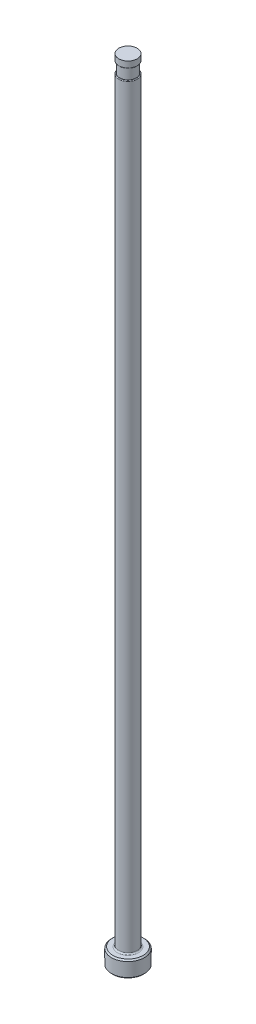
ISO-10303-21;
HEADER;
FILE_DESCRIPTION(('STEP AP214'),'2;1');
FILE_NAME('part.step','',(''),(''),'','','');
FILE_SCHEMA(('AUTOMOTIVE_DESIGN { 1 0 10303 214 1 1 1 1 }'));
ENDSEC;
DATA;
#1=APPLICATION_CONTEXT('core data for automotive mechanical design processes');
#2=APPLICATION_PROTOCOL_DEFINITION('international standard','automotive_design',2000,#1);
#3=PRODUCT_CONTEXT('',#1,'mechanical');
#4=PRODUCT('Part','Part','',(#3));
#5=PRODUCT_RELATED_PRODUCT_CATEGORY('part','',(#4));
#6=PRODUCT_DEFINITION_FORMATION('','',#4);
#7=PRODUCT_DEFINITION_CONTEXT('part definition',#1,'design');
#8=PRODUCT_DEFINITION('design','',#6,#7);
#9=PRODUCT_DEFINITION_SHAPE('','',#8);
#10=(LENGTH_UNIT() NAMED_UNIT(*) SI_UNIT(.MILLI.,.METRE.));
#11=(NAMED_UNIT(*) PLANE_ANGLE_UNIT() SI_UNIT($,.RADIAN.));
#12=(NAMED_UNIT(*) SI_UNIT($,.STERADIAN.) SOLID_ANGLE_UNIT());
#13=UNCERTAINTY_MEASURE_WITH_UNIT(LENGTH_MEASURE(1.E-05),#10,'distance_accuracy_value','');
#14=(GEOMETRIC_REPRESENTATION_CONTEXT(3) GLOBAL_UNCERTAINTY_ASSIGNED_CONTEXT((#13)) GLOBAL_UNIT_ASSIGNED_CONTEXT((#10,
#11,#12)) REPRESENTATION_CONTEXT('',''));
#15=CARTESIAN_POINT('',(0.,0.,0.));
#16=DIRECTION('',(0.,0.,1.));
#17=DIRECTION('',(1.,0.,0.));
#18=AXIS2_PLACEMENT_3D('',#15,#16,#17);
#19=CARTESIAN_POINT('',(-1.78561999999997,151.13,0.));
#20=DIRECTION('',(0.,1.,0.));
#21=DIRECTION('',(0.,0.,1.));
#22=AXIS2_PLACEMENT_3D('',#19,#20,#21);
#23=PLANE('',#22);
#24=CARTESIAN_POINT('',(0.,151.13,0.));
#25=DIRECTION('',(0.,1.,0.));
#26=DIRECTION('',(0.,0.,1.));
#27=AXIS2_PLACEMENT_3D('',#24,#25,#26);
#28=CIRCLE('',#27,1.64591999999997);
#29=CARTESIAN_POINT('',(0.,151.13,1.64591999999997));
#30=VERTEX_POINT('',#29);
#31=EDGE_CURVE('E11',#30,#30,#28,.F.);
#32=ORIENTED_EDGE('',*,*,#31,.T.);
#33=EDGE_LOOP('',(#32));
#34=FACE_BOUND('',#33,.T.);
#35=CARTESIAN_POINT('',(0.,151.13,0.));
#36=DIRECTION('',(0.,1.,0.));
#37=DIRECTION('',(0.,0.,1.));
#38=AXIS2_PLACEMENT_3D('',#35,#36,#37);
#39=CIRCLE('',#38,1.58241999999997);
#40=CARTESIAN_POINT('',(0.,151.13,1.58241999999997));
#41=VERTEX_POINT('',#40);
#42=EDGE_CURVE('E78',#41,#41,#39,.T.);
#43=ORIENTED_EDGE('',*,*,#42,.T.);
#44=EDGE_LOOP('',(#43));
#45=FACE_BOUND('',#44,.T.);
#46=ADVANCED_FACE('F36',(#34,#45),#23,.F.);
#47=CARTESIAN_POINT('',(0.,259.958771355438,0.));
#48=DIRECTION('',(0.,1.,0.));
#49=DIRECTION('',(0.,0.,1.));
#50=AXIS2_PLACEMENT_3D('',#47,#48,#49);
#51=CYLINDRICAL_SURFACE('',#50,1.78561999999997);
#52=DIRECTION('',(0.,1.,0.));
#53=VECTOR('',#52,1.);
#54=CARTESIAN_POINT('',(-1.58241999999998,259.958771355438,-0.827276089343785));
#55=LINE('',#54,#53);
#56=CARTESIAN_POINT('',(-1.58241999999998,148.971,-0.827276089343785));
#57=VERTEX_POINT('',#56);
#58=CARTESIAN_POINT('',(-1.58241999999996,86.614,-0.827276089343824));
#59=VERTEX_POINT('',#58);
#60=EDGE_CURVE('E73',#57,#59,#55,.F.);
#61=ORIENTED_EDGE('',*,*,#60,.F.);
#62=CARTESIAN_POINT('',(0.,148.971,0.));
#63=DIRECTION('',(0.,-1.,0.));
#64=DIRECTION('',(0.,0.,-1.));
#65=AXIS2_PLACEMENT_3D('',#62,#63,#64);
#66=CIRCLE('',#65,1.78561999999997);
#67=CARTESIAN_POINT('',(-1.58241999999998,148.971,0.827276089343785));
#68=VERTEX_POINT('',#67);
#69=EDGE_CURVE('E51',#57,#68,#66,.T.);
#70=ORIENTED_EDGE('',*,*,#69,.T.);
#71=DIRECTION('',(0.,1.,0.));
#72=VECTOR('',#71,1.);
#73=CARTESIAN_POINT('',(-1.58241999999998,259.958771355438,0.827276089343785));
#74=LINE('',#73,#72);
#75=CARTESIAN_POINT('',(-1.58241999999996,86.614,0.827276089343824));
#76=VERTEX_POINT('',#75);
#77=EDGE_CURVE('E84',#76,#68,#74,.T.);
#78=ORIENTED_EDGE('',*,*,#77,.F.);
#79=CARTESIAN_POINT('',(-1.58241999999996,86.614,-0.827276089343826));
#80=CARTESIAN_POINT('',(-1.58241859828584,86.57930589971,-0.827270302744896));
#81=CARTESIAN_POINT('',(-1.58298930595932,86.5446242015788,-0.826188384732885));
#82=CARTESIAN_POINT('',(-1.58525672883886,86.4754213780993,-0.821832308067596));
#83=CARTESIAN_POINT('',(-1.58695392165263,86.4409003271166,-0.81855721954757));
#84=CARTESIAN_POINT('',(-1.59374670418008,86.3372224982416,-0.805306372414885));
#85=CARTESIAN_POINT('',(-1.60054304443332,86.2685662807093,-0.791903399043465));
#86=CARTESIAN_POINT('',(-1.6181445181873,86.1342279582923,-0.755289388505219));
#87=CARTESIAN_POINT('',(-1.62896089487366,86.0685547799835,-0.732050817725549));
#88=CARTESIAN_POINT('',(-1.65351348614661,85.9428437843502,-0.674760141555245));
#89=CARTESIAN_POINT('',(-1.66723753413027,85.8827839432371,-0.640752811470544));
#90=CARTESIAN_POINT('',(-1.69108481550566,85.7895410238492,-0.574000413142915));
#91=CARTESIAN_POINT('',(-1.70092185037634,85.7539825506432,-0.544463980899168));
#92=CARTESIAN_POINT('',(-1.72024188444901,85.6880696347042,-0.479935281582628));
#93=CARTESIAN_POINT('',(-1.72972525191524,85.6577096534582,-0.444948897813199));
#94=CARTESIAN_POINT('',(-1.74591517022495,85.6079989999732,-0.375854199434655));
#95=CARTESIAN_POINT('',(-1.75282315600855,85.5876636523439,-0.34250427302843));
#96=CARTESIAN_POINT('',(-1.76503091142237,85.552596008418,-0.272685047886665));
#97=CARTESIAN_POINT('',(-1.7703313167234,85.5378614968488,-0.236216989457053));
#98=CARTESIAN_POINT('',(-1.77876737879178,85.5147234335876,-0.160839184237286));
#99=CARTESIAN_POINT('',(-1.78189089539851,85.5063553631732,-0.121917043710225));
#100=CARTESIAN_POINT('',(-1.78553515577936,85.4966126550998,-0.0430875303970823));
#101=CARTESIAN_POINT('',(-1.78605699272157,85.4952350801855,-0.00318057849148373));
#102=CARTESIAN_POINT('',(-1.78451570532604,85.499340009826,0.0723170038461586));
#103=CARTESIAN_POINT('',(-1.78269870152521,85.5041692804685,0.107950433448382));
#104=CARTESIAN_POINT('',(-1.77708661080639,85.5193299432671,0.177853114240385));
#105=CARTESIAN_POINT('',(-1.7732916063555,85.5296611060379,0.212122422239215));
#106=CARTESIAN_POINT('',(-1.76403207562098,85.5554906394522,0.278893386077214));
#107=CARTESIAN_POINT('',(-1.75854739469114,85.5710516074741,0.31136779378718));
#108=CARTESIAN_POINT('',(-1.74640529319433,85.6066424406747,0.373513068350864));
#109=CARTESIAN_POINT('',(-1.73974732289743,85.6266744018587,0.403182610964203));
#110=CARTESIAN_POINT('',(-1.72309018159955,85.6788692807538,0.470106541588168));
#111=CARTESIAN_POINT('',(-1.7127837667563,85.7127475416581,0.50595017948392));
#112=CARTESIAN_POINT('',(-1.69205421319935,85.7859822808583,0.57146965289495));
#113=CARTESIAN_POINT('',(-1.68163090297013,85.8253481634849,0.601134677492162));
#114=CARTESIAN_POINT('',(-1.65852628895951,85.9207765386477,0.662663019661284));
#115=CARTESIAN_POINT('',(-1.64612995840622,85.9782622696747,0.692421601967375));
#116=CARTESIAN_POINT('',(-1.62408795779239,86.0976981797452,0.742649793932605));
#117=CARTESIAN_POINT('',(-1.61444888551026,86.1596586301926,0.763097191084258));
#118=CARTESIAN_POINT('',(-1.5986900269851,86.2866358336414,0.795586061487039));
#119=CARTESIAN_POINT('',(-1.59259533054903,86.3516709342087,0.807567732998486));
#120=CARTESIAN_POINT('',(-1.58649588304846,86.4498700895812,0.819442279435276));
#121=CARTESIAN_POINT('',(-1.58496990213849,86.4826111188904,0.822384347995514));
#122=CARTESIAN_POINT('',(-1.58293155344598,86.5482312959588,0.826298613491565));
#123=CARTESIAN_POINT('',(-1.58241884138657,86.5811103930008,0.827271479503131));
#124=CARTESIAN_POINT('',(-1.58241999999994,86.6139999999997,0.827276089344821));
#125=B_SPLINE_CURVE_WITH_KNOTS('',3,(#79,#80,#81,#82,#83,#84,#85,#86,#87,#88,#89,#90,#91,#92,
#93,#94,#95,#96,#97,#98,#99,#100,#101,#102,#103,#104,#105,#106,#107,#108,#109,#110,#111,#112,
#113,#114,#115,#116,#117,#118,#119,#120,#121,#122,#123,#124),.UNSPECIFIED.,.F.,.F.,(4,2,2,2,2,2,
2,2,2,2,2,2,2,2,2,2,2,2,2,2,2,2,4),(0.,0.104035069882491,0.208114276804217,0.418101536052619,
0.628680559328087,0.838395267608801,0.979683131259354,1.12081951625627,1.23932997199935,
1.35779350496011,1.47691251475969,1.59598146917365,1.70348686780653,1.81098778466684,
1.91982417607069,2.02871169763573,2.1790397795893,2.32962872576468,2.5262950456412,
2.72342810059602,2.92194014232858,3.02060242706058,3.11923118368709),.UNSPECIFIED.);
#126=EDGE_CURVE('E81',#59,#76,#125,.T.);
#127=ORIENTED_EDGE('',*,*,#126,.F.);
#128=EDGE_LOOP('',(#61,#70,#78,#127));
#129=FACE_BOUND('',#128,.T.);
#130=CARTESIAN_POINT('',(0.,3.42900000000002,0.));
#131=DIRECTION('',(0.,1.,0.));
#132=DIRECTION('',(0.,0.,1.));
#133=AXIS2_PLACEMENT_3D('',#130,#131,#132);
#134=CIRCLE('',#133,1.78561999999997);
#135=CARTESIAN_POINT('',(0.,3.42900000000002,1.78561999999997));
#136=VERTEX_POINT('',#135);
#137=EDGE_CURVE('E116',#136,#136,#134,.T.);
#138=ORIENTED_EDGE('',*,*,#137,.T.);
#139=EDGE_LOOP('',(#138));
#140=FACE_BOUND('',#139,.T.);
#141=ADVANCED_FACE('F82',(#129,#140),#51,.T.);
#142=CARTESIAN_POINT('',(0.,0.,0.));
#143=DIRECTION('',(0.,-1.,0.));
#144=DIRECTION('',(0.,0.,-1.));
#145=AXIS2_PLACEMENT_3D('',#142,#143,#144);
#146=PLANE('',#145);
#147=CARTESIAN_POINT('',(0.,0.,0.));
#148=DIRECTION('',(0.,-1.,0.));
#149=DIRECTION('',(0.,0.,-1.));
#150=AXIS2_PLACEMENT_3D('',#147,#148,#149);
#151=CIRCLE('',#150,2.92099999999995);
#152=CARTESIAN_POINT('',(0.,0.,-2.92099999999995));
#153=VERTEX_POINT('',#152);
#154=EDGE_CURVE('E113',#153,#153,#151,.T.);
#155=ORIENTED_EDGE('',*,*,#154,.T.);
#156=EDGE_LOOP('',(#155));
#157=FACE_BOUND('',#156,.T.);
#158=ADVANCED_FACE('F192',(#157),#146,.T.);
#159=CARTESIAN_POINT('',(0.,259.958771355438,0.));
#160=DIRECTION('',(0.,1.,0.));
#161=DIRECTION('',(0.,0.,1.));
#162=AXIS2_PLACEMENT_3D('',#159,#160,#161);
#163=CYLINDRICAL_SURFACE('',#162,3.17499999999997);
#164=CARTESIAN_POINT('',(0.,2.92100000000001,0.));
#165=DIRECTION('',(0.,1.,0.));
#166=DIRECTION('',(0.,0.,1.));
#167=AXIS2_PLACEMENT_3D('',#164,#165,#166);
#168=CIRCLE('',#167,3.17499999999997);
#169=CARTESIAN_POINT('',(0.,2.92100000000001,3.17499999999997));
#170=VERTEX_POINT('',#169);
#171=EDGE_CURVE('E110',#170,#170,#168,.F.);
#172=ORIENTED_EDGE('',*,*,#171,.T.);
#173=EDGE_LOOP('',(#172));
#174=FACE_BOUND('',#173,.T.);
#175=CARTESIAN_POINT('',(0.,0.254000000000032,0.));
#176=DIRECTION('',(0.,-1.,0.));
#177=DIRECTION('',(0.,0.,-1.));
#178=AXIS2_PLACEMENT_3D('',#175,#176,#177);
#179=CIRCLE('',#178,3.17499999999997);
#180=CARTESIAN_POINT('',(0.,0.254000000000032,-3.17499999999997));
#181=VERTEX_POINT('',#180);
#182=EDGE_CURVE('E107',#181,#181,#179,.F.);
#183=ORIENTED_EDGE('',*,*,#182,.T.);
#184=EDGE_LOOP('',(#183));
#185=FACE_BOUND('',#184,.T.);
#186=ADVANCED_FACE('F195',(#174,#185),#163,.T.);
#187=CARTESIAN_POINT('',(-3.17499999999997,3.175,0.));
#188=DIRECTION('',(0.,1.,0.));
#189=DIRECTION('',(0.,0.,1.));
#190=AXIS2_PLACEMENT_3D('',#187,#188,#189);
#191=PLANE('',#190);
#192=CARTESIAN_POINT('',(0.,3.175,0.));
#193=DIRECTION('',(0.,1.,0.));
#194=DIRECTION('',(0.,0.,1.));
#195=AXIS2_PLACEMENT_3D('',#192,#193,#194);
#196=CIRCLE('',#195,2.03961999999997);
#197=CARTESIAN_POINT('',(0.,3.175,2.03961999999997));
#198=VERTEX_POINT('',#197);
#199=EDGE_CURVE('E87',#198,#198,#196,.F.);
#200=ORIENTED_EDGE('',*,*,#199,.T.);
#201=EDGE_LOOP('',(#200));
#202=FACE_BOUND('',#201,.T.);
#203=CARTESIAN_POINT('',(0.,3.175,0.));
#204=DIRECTION('',(0.,1.,0.));
#205=DIRECTION('',(0.,0.,1.));
#206=AXIS2_PLACEMENT_3D('',#203,#204,#205);
#207=CIRCLE('',#206,2.92099999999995);
#208=CARTESIAN_POINT('',(0.,3.175,2.92099999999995));
#209=VERTEX_POINT('',#208);
#210=EDGE_CURVE('E104',#209,#209,#207,.T.);
#211=ORIENTED_EDGE('',*,*,#210,.T.);
#212=EDGE_LOOP('',(#211));
#213=FACE_BOUND('',#212,.T.);
#214=ADVANCED_FACE('F190',(#202,#213),#191,.T.);
#215=CARTESIAN_POINT('',(0.,3.17499999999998,0.));
#216=DIRECTION('',(0.,-1.,0.));
#217=DIRECTION('',(0.,0.,-1.));
#218=AXIS2_PLACEMENT_3D('',#215,#216,#217);
#219=CONICAL_SURFACE('',#218,2.92099999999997,0.7853981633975);
#220=ORIENTED_EDGE('',*,*,#171,.F.);
#221=EDGE_LOOP('',(#220));
#222=FACE_BOUND('',#221,.T.);
#223=ORIENTED_EDGE('',*,*,#210,.F.);
#224=EDGE_LOOP('',(#223));
#225=FACE_BOUND('',#224,.T.);
#226=ADVANCED_FACE('F186',(#222,#225),#219,.T.);
#227=CARTESIAN_POINT('',(0.,0.254000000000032,0.));
#228=DIRECTION('',(0.,1.,0.));
#229=DIRECTION('',(0.,0.,1.));
#230=AXIS2_PLACEMENT_3D('',#227,#228,#229);
#231=CONICAL_SURFACE('',#230,3.17499999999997,0.785398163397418);
#232=ORIENTED_EDGE('',*,*,#154,.F.);
#233=EDGE_LOOP('',(#232));
#234=FACE_BOUND('',#233,.T.);
#235=ORIENTED_EDGE('',*,*,#182,.F.);
#236=EDGE_LOOP('',(#235));
#237=FACE_BOUND('',#236,.T.);
#238=ADVANCED_FACE('F182',(#234,#237),#231,.T.);
#239=CARTESIAN_POINT('',(0.,3.42900000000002,0.));
#240=DIRECTION('',(0.,1.,0.));
#241=DIRECTION('',(0.,0.,1.));
#242=AXIS2_PLACEMENT_3D('',#239,#240,#241);
#243=TOROIDAL_SURFACE('',#242,2.03961999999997,0.254);
#244=ORIENTED_EDGE('',*,*,#199,.F.);
#245=EDGE_LOOP('',(#244));
#246=FACE_BOUND('',#245,.T.);
#247=ORIENTED_EDGE('',*,*,#137,.F.);
#248=EDGE_LOOP('',(#247));
#249=FACE_BOUND('',#248,.T.);
#250=ADVANCED_FACE('F147',(#246,#249),#243,.F.);
#251=CARTESIAN_POINT('',(-1.78561999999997,149.098,0.));
#252=DIRECTION('',(0.,-1.,0.));
#253=DIRECTION('',(0.,0.,-1.));
#254=AXIS2_PLACEMENT_3D('',#251,#252,#253);
#255=PLANE('',#254);
#256=DIRECTION('',(0.,0.,1.));
#257=VECTOR('',#256,1.);
#258=CARTESIAN_POINT('',(-1.58241999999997,149.098,0.));
#259=LINE('',#258,#257);
#260=CARTESIAN_POINT('',(-1.58241999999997,149.098,0.));
#261=VERTEX_POINT('',#260);
#262=CARTESIAN_POINT('',(-1.58241999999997,149.098,0.496957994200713));
#263=VERTEX_POINT('',#262);
#264=EDGE_CURVE('E90',#261,#263,#259,.T.);
#265=ORIENTED_EDGE('',*,*,#264,.T.);
#266=CARTESIAN_POINT('',(0.,149.098,0.));
#267=DIRECTION('',(0.,-1.,0.));
#268=DIRECTION('',(0.,0.,-1.));
#269=AXIS2_PLACEMENT_3D('',#266,#267,#268);
#270=CIRCLE('',#269,1.65861999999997);
#271=CARTESIAN_POINT('',(-1.58241999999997,149.098,-0.496957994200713));
#272=VERTEX_POINT('',#271);
#273=EDGE_CURVE('E86',#263,#272,#270,.F.);
#274=ORIENTED_EDGE('',*,*,#273,.T.);
#275=EDGE_CURVE('E79',#272,#261,#259,.T.);
#276=ORIENTED_EDGE('',*,*,#275,.T.);
#277=CARTESIAN_POINT('',(0.,149.098,0.));
#278=DIRECTION('',(0.,1.,0.));
#279=DIRECTION('',(0.,0.,1.));
#280=AXIS2_PLACEMENT_3D('',#277,#278,#279);
#281=CIRCLE('',#280,1.58241999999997);
#282=EDGE_CURVE('E101',#261,#261,#281,.T.);
#283=ORIENTED_EDGE('',*,*,#282,.F.);
#284=EDGE_LOOP('',(#265,#274,#276,#283));
#285=FACE_BOUND('',#284,.T.);
#286=ADVANCED_FACE('F144',(#285),#255,.F.);
#287=CARTESIAN_POINT('',(0.,153.448281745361,0.));
#288=DIRECTION('',(0.,1.,0.));
#289=DIRECTION('',(0.,0.,1.));
#290=AXIS2_PLACEMENT_3D('',#287,#288,#289);
#291=CYLINDRICAL_SURFACE('',#290,1.58241999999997);
#292=ORIENTED_EDGE('',*,*,#42,.F.);
#293=EDGE_LOOP('',(#292));
#294=FACE_BOUND('',#293,.T.);
#295=ORIENTED_EDGE('',*,*,#282,.T.);
#296=EDGE_LOOP('',(#295));
#297=FACE_BOUND('',#296,.T.);
#298=ADVANCED_FACE('F141',(#294,#297),#291,.T.);
#299=CARTESIAN_POINT('',(-1.58241999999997,150.114,-3.17499999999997));
#300=DIRECTION('',(1.,0.,0.));
#301=DIRECTION('',(0.,1.,0.));
#302=AXIS2_PLACEMENT_3D('',#299,#300,#301);
#303=PLANE('',#302);
#304=ORIENTED_EDGE('',*,*,#275,.F.);
#305=CARTESIAN_POINT('',(-1.58241999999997,149.098,-0.496957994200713));
#306=CARTESIAN_POINT('',(-1.58241999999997,149.097990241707,-0.513789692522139));
#307=CARTESIAN_POINT('',(-1.58241999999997,149.09769820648,-0.530633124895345));
#308=CARTESIAN_POINT('',(-1.58241999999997,149.096318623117,-0.56437499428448));
#309=CARTESIAN_POINT('',(-1.58241999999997,149.095226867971,-0.58127324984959));
#310=CARTESIAN_POINT('',(-1.58241999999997,149.092012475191,-0.614973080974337));
#311=CARTESIAN_POINT('',(-1.58241999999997,149.089890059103,-0.631774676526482));
#312=CARTESIAN_POINT('',(-1.58241999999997,149.084280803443,-0.665126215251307));
#313=CARTESIAN_POINT('',(-1.58241999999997,149.080797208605,-0.681676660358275));
#314=CARTESIAN_POINT('',(-1.58241999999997,149.074084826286,-0.706389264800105));
#315=CARTESIAN_POINT('',(-1.58241999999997,149.071547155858,-0.714738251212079));
#316=CARTESIAN_POINT('',(-1.58241999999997,149.06584368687,-0.73126480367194));
#317=CARTESIAN_POINT('',(-1.58241999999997,149.062675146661,-0.739441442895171));
#318=CARTESIAN_POINT('',(-1.58241999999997,149.054581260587,-0.75771242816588));
#319=CARTESIAN_POINT('',(-1.58241999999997,149.049412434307,-0.76770109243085));
#320=CARTESIAN_POINT('',(-1.58241999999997,149.037398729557,-0.786606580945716));
#321=CARTESIAN_POINT('',(-1.58241999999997,149.030567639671,-0.795531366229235));
#322=CARTESIAN_POINT('',(-1.58241999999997,149.019582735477,-0.80632073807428));
#323=CARTESIAN_POINT('',(-1.58241999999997,149.016377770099,-0.809143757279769));
#324=CARTESIAN_POINT('',(-1.58241999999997,149.009610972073,-0.814338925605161));
#325=CARTESIAN_POINT('',(-1.58241999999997,149.006048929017,-0.816710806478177));
#326=CARTESIAN_POINT('',(-1.58241999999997,148.998529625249,-0.820873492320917));
#327=CARTESIAN_POINT('',(-1.58241999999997,148.994567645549,-0.822655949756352));
#328=CARTESIAN_POINT('',(-1.58241999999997,148.98637382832,-0.825404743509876));
#329=CARTESIAN_POINT('',(-1.58241999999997,148.982143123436,-0.826374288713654));
#330=CARTESIAN_POINT('',(-1.58241999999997,148.976726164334,-0.827008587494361));
#331=CARTESIAN_POINT('',(-1.58241999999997,148.975583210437,-0.827108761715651));
#332=CARTESIAN_POINT('',(-1.58241999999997,148.973293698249,-0.827242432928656));
#333=CARTESIAN_POINT('',(-1.58241999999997,148.972147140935,-0.827275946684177));
#334=CARTESIAN_POINT('',(-1.58241999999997,148.971,-0.827276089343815));
#335=B_SPLINE_CURVE_WITH_KNOTS('',3,(#305,#306,#307,#308,#309,#310,#311,#312,#313,#314,#315,
#316,#317,#318,#319,#320,#321,#322,#323,#324,#325,#326,#327,#328,#329,#330,#331,#332,#333,#334),
.UNSPECIFIED.,.F.,.F.,(4,2,2,2,2,2,2,2,2,2,2,2,2,2,4),(0.,0.0505111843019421,0.101290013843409,
0.152057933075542,0.202705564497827,0.228865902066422,0.255142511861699,0.288792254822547,
0.322171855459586,0.33495504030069,0.347745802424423,0.360710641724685,0.373624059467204,
0.377064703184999,0.380504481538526),.UNSPECIFIED.);
#336=EDGE_CURVE('E59',#272,#57,#335,.T.);
#337=ORIENTED_EDGE('',*,*,#336,.T.);
#338=ORIENTED_EDGE('',*,*,#60,.T.);
#339=DIRECTION('',(0.,0.,1.));
#340=VECTOR('',#339,1.);
#341=CARTESIAN_POINT('',(-1.58241999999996,86.614,-3.17499999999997));
#342=LINE('',#341,#340);
#343=EDGE_CURVE('E77',#59,#76,#342,.T.);
#344=ORIENTED_EDGE('',*,*,#343,.T.);
#345=ORIENTED_EDGE('',*,*,#77,.T.);
#346=CARTESIAN_POINT('',(-1.58241999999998,148.971,0.827276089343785));
#347=CARTESIAN_POINT('',(-1.58241999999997,148.974578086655,0.827284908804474));
#348=CARTESIAN_POINT('',(-1.58241999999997,148.978145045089,0.82695017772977));
#349=CARTESIAN_POINT('',(-1.58241999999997,148.985132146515,0.825674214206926));
#350=CARTESIAN_POINT('',(-1.58241999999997,148.988553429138,0.824739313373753));
#351=CARTESIAN_POINT('',(-1.58241999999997,148.995944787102,0.822072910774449));
#352=CARTESIAN_POINT('',(-1.58241999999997,148.999866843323,0.8202101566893));
#353=CARTESIAN_POINT('',(-1.58241999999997,149.007366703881,0.815871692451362));
#354=CARTESIAN_POINT('',(-1.58241999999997,149.010942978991,0.813393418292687));
#355=CARTESIAN_POINT('',(-1.58241999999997,149.019559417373,0.806534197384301));
#356=CARTESIAN_POINT('',(-1.58241999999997,149.024353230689,0.801846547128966));
#357=CARTESIAN_POINT('',(-1.58241999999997,149.033183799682,0.791817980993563));
#358=CARTESIAN_POINT('',(-1.58241999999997,149.037219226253,0.786475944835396));
#359=CARTESIAN_POINT('',(-1.58241999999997,149.047959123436,0.770471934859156));
#360=CARTESIAN_POINT('',(-1.58241999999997,149.053868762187,0.759282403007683));
#361=CARTESIAN_POINT('',(-1.58241999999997,149.064145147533,0.7361604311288));
#362=CARTESIAN_POINT('',(-1.58241999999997,149.068499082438,0.724222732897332));
#363=CARTESIAN_POINT('',(-1.58241999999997,149.077780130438,0.694353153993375));
#364=CARTESIAN_POINT('',(-1.58241999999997,149.082032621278,0.676214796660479));
#365=CARTESIAN_POINT('',(-1.58241999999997,149.088803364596,0.639581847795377));
#366=CARTESIAN_POINT('',(-1.58241999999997,149.091315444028,0.62108622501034));
#367=CARTESIAN_POINT('',(-1.58241999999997,149.094962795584,0.584931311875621));
#368=CARTESIAN_POINT('',(-1.58241999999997,149.096162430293,0.567278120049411));
#369=CARTESIAN_POINT('',(-1.58241999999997,149.097671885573,0.532064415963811));
#370=CARTESIAN_POINT('',(-1.58241999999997,149.097988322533,0.51450420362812));
#371=CARTESIAN_POINT('',(-1.58241999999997,149.098,0.496957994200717));
#372=B_SPLINE_CURVE_WITH_KNOTS('',3,(#346,#347,#348,#349,#350,#351,#352,#353,#354,#355,#356,
#357,#358,#359,#360,#361,#362,#363,#364,#365,#366,#367,#368,#369,#370,#371),.UNSPECIFIED.,.F.,
.F.,(4,2,2,2,2,2,2,2,2,2,2,2,4),(0.,0.0107006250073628,0.0212901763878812,0.0342440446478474,
0.0472528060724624,0.0672536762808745,0.0872892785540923,0.125039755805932,0.163094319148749,
0.218841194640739,0.274784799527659,0.327841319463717,0.380499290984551),.UNSPECIFIED.);
#373=EDGE_CURVE('E172',#68,#263,#372,.T.);
#374=ORIENTED_EDGE('',*,*,#373,.T.);
#375=ORIENTED_EDGE('',*,*,#264,.F.);
#376=EDGE_LOOP('',(#304,#337,#338,#344,#345,#374,#375));
#377=FACE_BOUND('',#376,.T.);
#378=ADVANCED_FACE('F75',(#377),#303,.F.);
#379=CARTESIAN_POINT('',(-4.75741999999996,86.614,-3.17499999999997));
#380=DIRECTION('',(0.,0.,1.));
#381=DIRECTION('',(1.,0.,0.));
#382=AXIS2_PLACEMENT_3D('',#379,#380,#381);
#383=CYLINDRICAL_SURFACE('',#382,3.175);
#384=ORIENTED_EDGE('',*,*,#343,.F.);
#385=ORIENTED_EDGE('',*,*,#126,.T.);
#386=EDGE_LOOP('',(#384,#385));
#387=FACE_BOUND('',#386,.T.);
#388=ADVANCED_FACE('F89',(#387),#383,.F.);
#389=CARTESIAN_POINT('',(0.,152.687735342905,0.));
#390=DIRECTION('',(0.,1.,0.));
#391=DIRECTION('',(0.,0.,1.));
#392=AXIS2_PLACEMENT_3D('',#389,#390,#391);
#393=CYLINDRICAL_SURFACE('',#392,1.77291999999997);
#394=CARTESIAN_POINT('',(0.,151.257,0.));
#395=DIRECTION('',(0.,1.,0.));
#396=DIRECTION('',(0.,0.,1.));
#397=AXIS2_PLACEMENT_3D('',#394,#395,#396);
#398=CIRCLE('',#397,1.77291999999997);
#399=CARTESIAN_POINT('',(0.,151.257,1.77291999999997));
#400=VERTEX_POINT('',#399);
#401=EDGE_CURVE('E44',#400,#400,#398,.T.);
#402=ORIENTED_EDGE('',*,*,#401,.T.);
#403=EDGE_LOOP('',(#402));
#404=FACE_BOUND('',#403,.T.);
#405=CARTESIAN_POINT('',(0.,152.4,0.));
#406=DIRECTION('',(0.,1.,0.));
#407=DIRECTION('',(0.,0.,1.));
#408=AXIS2_PLACEMENT_3D('',#405,#406,#407);
#409=CIRCLE('',#408,1.77291999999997);
#410=CARTESIAN_POINT('',(0.,152.4,1.77291999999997));
#411=VERTEX_POINT('',#410);
#412=EDGE_CURVE('E91',#411,#411,#409,.T.);
#413=ORIENTED_EDGE('',*,*,#412,.F.);
#414=EDGE_LOOP('',(#413));
#415=FACE_BOUND('',#414,.T.);
#416=ADVANCED_FACE('F135',(#404,#415),#393,.T.);
#417=CARTESIAN_POINT('',(-1.78561999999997,152.4,0.));
#418=DIRECTION('',(0.,1.,0.));
#419=DIRECTION('',(0.,0.,1.));
#420=AXIS2_PLACEMENT_3D('',#417,#418,#419);
#421=PLANE('',#420);
#422=ORIENTED_EDGE('',*,*,#412,.T.);
#423=EDGE_LOOP('',(#422));
#424=FACE_BOUND('',#423,.T.);
#425=ADVANCED_FACE('F149',(#424),#421,.T.);
#426=CARTESIAN_POINT('',(0.,148.971,0.));
#427=DIRECTION('',(0.,-1.,0.));
#428=DIRECTION('',(0.,0.,-1.));
#429=AXIS2_PLACEMENT_3D('',#426,#427,#428);
#430=TOROIDAL_SURFACE('',#429,1.65861999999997,0.127);
#431=ORIENTED_EDGE('',*,*,#373,.F.);
#432=ORIENTED_EDGE('',*,*,#69,.F.);
#433=ORIENTED_EDGE('',*,*,#336,.F.);
#434=ORIENTED_EDGE('',*,*,#273,.F.);
#435=EDGE_LOOP('',(#431,#432,#433,#434));
#436=FACE_BOUND('',#435,.T.);
#437=ADVANCED_FACE('F151',(#436),#430,.T.);
#438=CARTESIAN_POINT('',(0.,151.257,0.));
#439=DIRECTION('',(0.,1.,0.));
#440=DIRECTION('',(0.,0.,1.));
#441=AXIS2_PLACEMENT_3D('',#438,#439,#440);
#442=TOROIDAL_SURFACE('',#441,1.64591999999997,0.127);
#443=ORIENTED_EDGE('',*,*,#31,.F.);
#444=EDGE_LOOP('',(#443));
#445=FACE_BOUND('',#444,.T.);
#446=ORIENTED_EDGE('',*,*,#401,.F.);
#447=EDGE_LOOP('',(#446));
#448=FACE_BOUND('',#447,.T.);
#449=ADVANCED_FACE('F38',(#445,#448),#442,.T.);
#450=CLOSED_SHELL('',(#46,#141,#158,#186,#214,#226,#238,#250,#286,#298,#378,#388,#416,#425,#437,#449));
#451=MANIFOLD_SOLID_BREP('B2',#450);
#452=ADVANCED_BREP_SHAPE_REPRESENTATION('',(#18,#451),#14);
#453=SHAPE_DEFINITION_REPRESENTATION(#9,#452);
ENDSEC;
END-ISO-10303-21;
